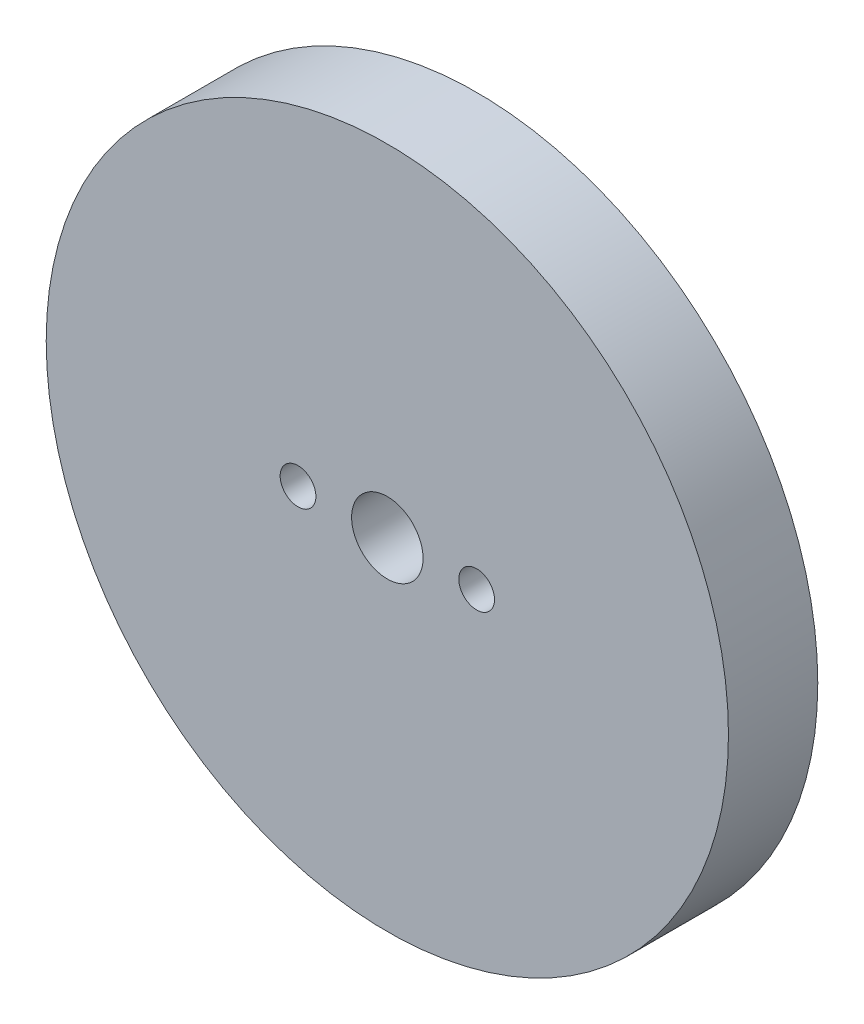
from build123d import *

# Parameters (mm, degrees)
SKETCH1_R           = 19.095
BOSS_EXTRUDE1_DEPTH = 5
SKETCH2_R           = 2
SKETCH2_R_2         = 1
CUT_EXTRUDE1_DEPTH  = 5


with BuildPart() as part:
    # Sketch1 → Boss-Extrude1 (new body)
    with BuildSketch(Plane.XY):
        Circle(SKETCH1_R)
    extrude(amount=BOSS_EXTRUDE1_DEPTH)

    # Sketch2 → Cut-Extrude1 (cut)
    with BuildSketch(Plane.XY.offset(5)):
        Circle(SKETCH2_R)
        with Locations((5, 0)):
            Circle(SKETCH2_R_2)
        with Locations((-5, 0)):
            Circle(SKETCH2_R_2)
    extrude(amount=-CUT_EXTRUDE1_DEPTH, mode=Mode.SUBTRACT)


solid = part.part
